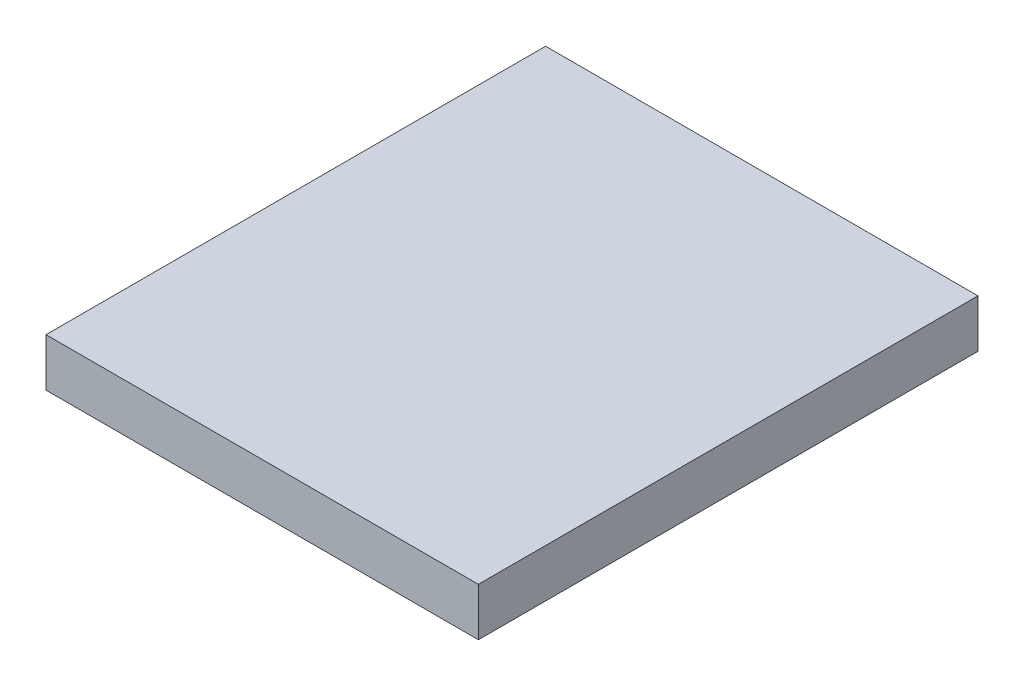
ISO-10303-21;
HEADER;
FILE_DESCRIPTION(('STEP AP214'),'2;1');
FILE_NAME('part.step','',(''),(''),'','','');
FILE_SCHEMA(('AUTOMOTIVE_DESIGN { 1 0 10303 214 1 1 1 1 }'));
ENDSEC;
DATA;
#1=APPLICATION_CONTEXT('core data for automotive mechanical design processes');
#2=APPLICATION_PROTOCOL_DEFINITION('international standard','automotive_design',2000,#1);
#3=PRODUCT_CONTEXT('',#1,'mechanical');
#4=PRODUCT('Part','Part','',(#3));
#5=PRODUCT_RELATED_PRODUCT_CATEGORY('part','',(#4));
#6=PRODUCT_DEFINITION_FORMATION('','',#4);
#7=PRODUCT_DEFINITION_CONTEXT('part definition',#1,'design');
#8=PRODUCT_DEFINITION('design','',#6,#7);
#9=PRODUCT_DEFINITION_SHAPE('','',#8);
#10=(LENGTH_UNIT() NAMED_UNIT(*) SI_UNIT(.MILLI.,.METRE.));
#11=(NAMED_UNIT(*) PLANE_ANGLE_UNIT() SI_UNIT($,.RADIAN.));
#12=(NAMED_UNIT(*) SI_UNIT($,.STERADIAN.) SOLID_ANGLE_UNIT());
#13=UNCERTAINTY_MEASURE_WITH_UNIT(LENGTH_MEASURE(1.E-05),#10,'distance_accuracy_value','');
#14=(GEOMETRIC_REPRESENTATION_CONTEXT(3) GLOBAL_UNCERTAINTY_ASSIGNED_CONTEXT((#13)) GLOBAL_UNIT_ASSIGNED_CONTEXT((#10,
#11,#12)) REPRESENTATION_CONTEXT('',''));
#15=CARTESIAN_POINT('',(0.,0.,0.));
#16=DIRECTION('',(0.,0.,1.));
#17=DIRECTION('',(1.,0.,0.));
#18=AXIS2_PLACEMENT_3D('',#15,#16,#17);
#19=CARTESIAN_POINT('',(0.,1.2,0.));
#20=DIRECTION('',(0.,1.,0.));
#21=DIRECTION('',(0.,0.,1.));
#22=AXIS2_PLACEMENT_3D('',#19,#20,#21);
#23=PLANE('',#22);
#24=DIRECTION('',(1.,0.,0.));
#25=VECTOR('',#24,1.);
#26=CARTESIAN_POINT('',(11.0142135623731,1.2,2.6));
#27=LINE('',#26,#25);
#28=CARTESIAN_POINT('',(15.5142135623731,1.2,2.6));
#29=VERTEX_POINT('',#28);
#30=CARTESIAN_POINT('',(11.0142135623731,1.2,2.6));
#31=VERTEX_POINT('',#30);
#32=EDGE_CURVE('E58',#29,#31,#27,.F.);
#33=ORIENTED_EDGE('',*,*,#32,.F.);
#34=DIRECTION('',(0.,0.,-1.));
#35=VECTOR('',#34,1.);
#36=CARTESIAN_POINT('',(15.5142135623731,1.2,2.6));
#37=LINE('',#36,#35);
#38=CARTESIAN_POINT('',(15.5142135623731,1.2,-2.6));
#39=VERTEX_POINT('',#38);
#40=EDGE_CURVE('E53',#39,#29,#37,.F.);
#41=ORIENTED_EDGE('',*,*,#40,.F.);
#42=DIRECTION('',(-1.,0.,0.));
#43=VECTOR('',#42,1.);
#44=CARTESIAN_POINT('',(15.5142135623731,1.2,-2.6));
#45=LINE('',#44,#43);
#46=CARTESIAN_POINT('',(11.0142135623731,1.2,-2.6));
#47=VERTEX_POINT('',#46);
#48=EDGE_CURVE('E68',#47,#39,#45,.F.);
#49=ORIENTED_EDGE('',*,*,#48,.F.);
#50=DIRECTION('',(0.,0.,1.));
#51=VECTOR('',#50,1.);
#52=CARTESIAN_POINT('',(11.0142135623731,1.2,-2.6));
#53=LINE('',#52,#51);
#54=EDGE_CURVE('E20',#31,#47,#53,.F.);
#55=ORIENTED_EDGE('',*,*,#54,.F.);
#56=EDGE_LOOP('',(#33,#41,#49,#55));
#57=FACE_BOUND('',#56,.T.);
#58=ADVANCED_FACE('F17',(#57),#23,.T.);
#59=CARTESIAN_POINT('',(11.0142135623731,0.7,-2.6));
#60=DIRECTION('',(-1.,0.,0.));
#61=DIRECTION('',(0.,0.,1.));
#62=AXIS2_PLACEMENT_3D('',#59,#60,#61);
#63=PLANE('',#62);
#64=DIRECTION('',(0.,0.,1.));
#65=VECTOR('',#64,1.);
#66=CARTESIAN_POINT('',(11.0142135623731,0.7,0.));
#67=LINE('',#66,#65);
#68=CARTESIAN_POINT('',(11.0142135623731,0.7,-2.6));
#69=VERTEX_POINT('',#68);
#70=CARTESIAN_POINT('',(11.0142135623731,0.7,2.6));
#71=VERTEX_POINT('',#70);
#72=EDGE_CURVE('E74',#69,#71,#67,.T.);
#73=ORIENTED_EDGE('',*,*,#72,.T.);
#74=DIRECTION('',(0.,1.,0.));
#75=VECTOR('',#74,1.);
#76=CARTESIAN_POINT('',(11.0142135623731,0.7,2.6));
#77=LINE('',#76,#75);
#78=EDGE_CURVE('E63',#31,#71,#77,.F.);
#79=ORIENTED_EDGE('',*,*,#78,.F.);
#80=ORIENTED_EDGE('',*,*,#54,.T.);
#81=DIRECTION('',(0.,1.,0.));
#82=VECTOR('',#81,1.);
#83=CARTESIAN_POINT('',(11.0142135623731,0.7,-2.6));
#84=LINE('',#83,#82);
#85=EDGE_CURVE('E81',#69,#47,#84,.T.);
#86=ORIENTED_EDGE('',*,*,#85,.F.);
#87=EDGE_LOOP('',(#73,#79,#80,#86));
#88=FACE_BOUND('',#87,.T.);
#89=ADVANCED_FACE('F73',(#88),#63,.T.);
#90=CARTESIAN_POINT('',(11.0142135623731,0.7,2.6));
#91=DIRECTION('',(0.,0.,1.));
#92=DIRECTION('',(1.,0.,0.));
#93=AXIS2_PLACEMENT_3D('',#90,#91,#92);
#94=PLANE('',#93);
#95=DIRECTION('',(1.,0.,0.));
#96=VECTOR('',#95,1.);
#97=CARTESIAN_POINT('',(0.,0.7,2.6));
#98=LINE('',#97,#96);
#99=CARTESIAN_POINT('',(15.5142135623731,0.7,2.6));
#100=VERTEX_POINT('',#99);
#101=EDGE_CURVE('E84',#71,#100,#98,.T.);
#102=ORIENTED_EDGE('',*,*,#101,.T.);
#103=DIRECTION('',(0.,1.,0.));
#104=VECTOR('',#103,1.);
#105=CARTESIAN_POINT('',(15.5142135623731,0.7,2.6));
#106=LINE('',#105,#104);
#107=EDGE_CURVE('E65',#29,#100,#106,.F.);
#108=ORIENTED_EDGE('',*,*,#107,.F.);
#109=ORIENTED_EDGE('',*,*,#32,.T.);
#110=ORIENTED_EDGE('',*,*,#78,.T.);
#111=EDGE_LOOP('',(#102,#108,#109,#110));
#112=FACE_BOUND('',#111,.T.);
#113=ADVANCED_FACE('F61',(#112),#94,.T.);
#114=CARTESIAN_POINT('',(15.5142135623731,0.7,2.6));
#115=DIRECTION('',(1.,0.,0.));
#116=DIRECTION('',(0.,0.,-1.));
#117=AXIS2_PLACEMENT_3D('',#114,#115,#116);
#118=PLANE('',#117);
#119=DIRECTION('',(0.,0.,1.));
#120=VECTOR('',#119,1.);
#121=CARTESIAN_POINT('',(15.5142135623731,0.7,0.));
#122=LINE('',#121,#120);
#123=CARTESIAN_POINT('',(15.5142135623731,0.7,-2.6));
#124=VERTEX_POINT('',#123);
#125=EDGE_CURVE('E26',#100,#124,#122,.F.);
#126=ORIENTED_EDGE('',*,*,#125,.T.);
#127=DIRECTION('',(0.,1.,0.));
#128=VECTOR('',#127,1.);
#129=CARTESIAN_POINT('',(15.5142135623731,0.7,-2.6));
#130=LINE('',#129,#128);
#131=EDGE_CURVE('E34',#39,#124,#130,.F.);
#132=ORIENTED_EDGE('',*,*,#131,.F.);
#133=ORIENTED_EDGE('',*,*,#40,.T.);
#134=ORIENTED_EDGE('',*,*,#107,.T.);
#135=EDGE_LOOP('',(#126,#132,#133,#134));
#136=FACE_BOUND('',#135,.T.);
#137=ADVANCED_FACE('F88',(#136),#118,.T.);
#138=CARTESIAN_POINT('',(15.5142135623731,0.7,-2.6));
#139=DIRECTION('',(0.,0.,-1.));
#140=DIRECTION('',(-1.,0.,0.));
#141=AXIS2_PLACEMENT_3D('',#138,#139,#140);
#142=PLANE('',#141);
#143=DIRECTION('',(1.,0.,0.));
#144=VECTOR('',#143,1.);
#145=CARTESIAN_POINT('',(0.,0.7,-2.6));
#146=LINE('',#145,#144);
#147=EDGE_CURVE('E11',#124,#69,#146,.F.);
#148=ORIENTED_EDGE('',*,*,#147,.T.);
#149=ORIENTED_EDGE('',*,*,#85,.T.);
#150=ORIENTED_EDGE('',*,*,#48,.T.);
#151=ORIENTED_EDGE('',*,*,#131,.T.);
#152=EDGE_LOOP('',(#148,#149,#150,#151));
#153=FACE_BOUND('',#152,.T.);
#154=ADVANCED_FACE('F91',(#153),#142,.T.);
#155=CARTESIAN_POINT('',(0.,0.7,0.));
#156=DIRECTION('',(0.,1.,0.));
#157=DIRECTION('',(0.,0.,1.));
#158=AXIS2_PLACEMENT_3D('',#155,#156,#157);
#159=PLANE('',#158);
#160=ORIENTED_EDGE('',*,*,#125,.F.);
#161=ORIENTED_EDGE('',*,*,#101,.F.);
#162=ORIENTED_EDGE('',*,*,#72,.F.);
#163=ORIENTED_EDGE('',*,*,#147,.F.);
#164=EDGE_LOOP('',(#160,#161,#162,#163));
#165=FACE_BOUND('',#164,.T.);
#166=ADVANCED_FACE('F90',(#165),#159,.F.);
#167=CLOSED_SHELL('',(#58,#89,#113,#137,#154,#166));
#168=MANIFOLD_SOLID_BREP('B1',#167);
#169=ADVANCED_BREP_SHAPE_REPRESENTATION('',(#18,#168),#14);
#170=SHAPE_DEFINITION_REPRESENTATION(#9,#169);
ENDSEC;
END-ISO-10303-21;
